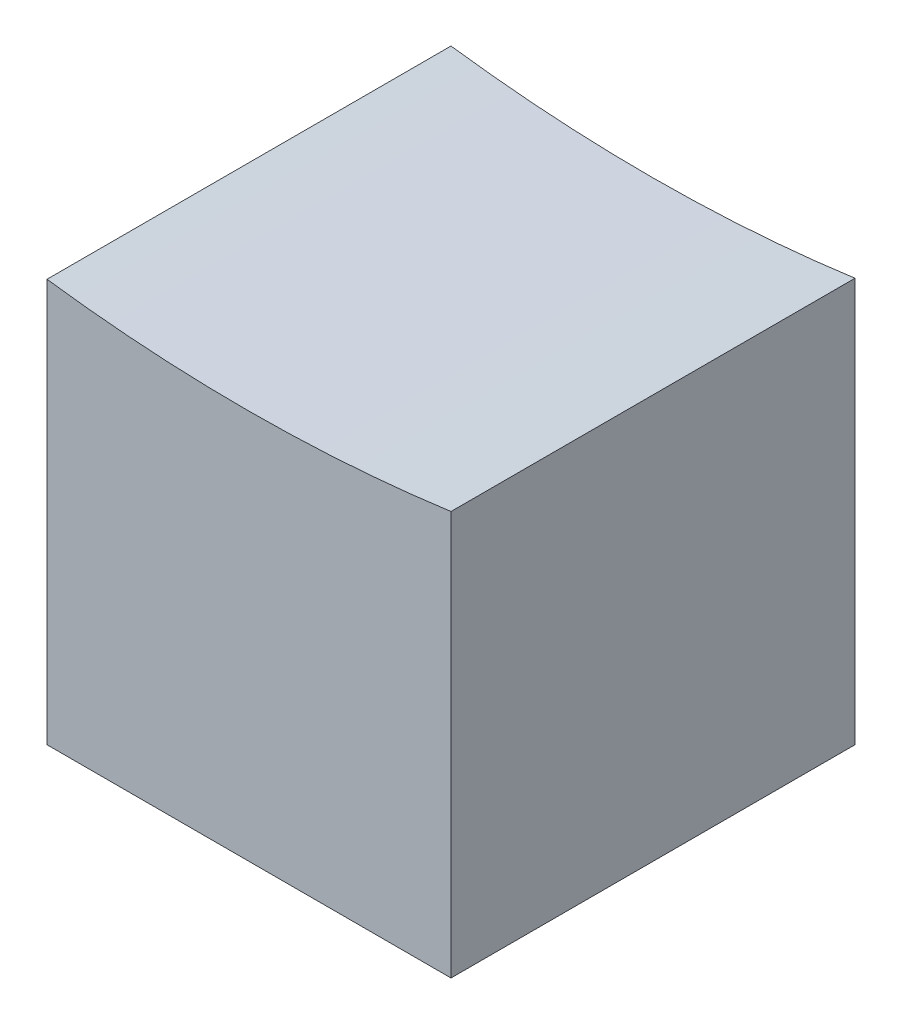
ISO-10303-21;
HEADER;
FILE_DESCRIPTION(('STEP AP214'),'2;1');
FILE_NAME('part.step','',(''),(''),'','','');
FILE_SCHEMA(('AUTOMOTIVE_DESIGN { 1 0 10303 214 1 1 1 1 }'));
ENDSEC;
DATA;
#1=APPLICATION_CONTEXT('core data for automotive mechanical design processes');
#2=APPLICATION_PROTOCOL_DEFINITION('international standard','automotive_design',2000,#1);
#3=PRODUCT_CONTEXT('',#1,'mechanical');
#4=PRODUCT('Part','Part','',(#3));
#5=PRODUCT_RELATED_PRODUCT_CATEGORY('part','',(#4));
#6=PRODUCT_DEFINITION_FORMATION('','',#4);
#7=PRODUCT_DEFINITION_CONTEXT('part definition',#1,'design');
#8=PRODUCT_DEFINITION('design','',#6,#7);
#9=PRODUCT_DEFINITION_SHAPE('','',#8);
#10=(LENGTH_UNIT() NAMED_UNIT(*) SI_UNIT(.MILLI.,.METRE.));
#11=(NAMED_UNIT(*) PLANE_ANGLE_UNIT() SI_UNIT($,.RADIAN.));
#12=(NAMED_UNIT(*) SI_UNIT($,.STERADIAN.) SOLID_ANGLE_UNIT());
#13=UNCERTAINTY_MEASURE_WITH_UNIT(LENGTH_MEASURE(1.E-05),#10,'distance_accuracy_value','');
#14=(GEOMETRIC_REPRESENTATION_CONTEXT(3) GLOBAL_UNCERTAINTY_ASSIGNED_CONTEXT((#13)) GLOBAL_UNIT_ASSIGNED_CONTEXT((#10,
#11,#12)) REPRESENTATION_CONTEXT('',''));
#15=CARTESIAN_POINT('',(0.,0.,0.));
#16=DIRECTION('',(0.,0.,1.));
#17=DIRECTION('',(1.,0.,0.));
#18=AXIS2_PLACEMENT_3D('',#15,#16,#17);
#19=CARTESIAN_POINT('',(0.,0.,30.));
#20=DIRECTION('',(0.,0.,-1.));
#21=DIRECTION('',(-1.,0.,0.));
#22=AXIS2_PLACEMENT_3D('',#19,#20,#21);
#23=CYLINDRICAL_SURFACE('',#22,111.3);
#24=CARTESIAN_POINT('',(0.,0.,0.));
#25=DIRECTION('',(0.,0.,-1.));
#26=DIRECTION('',(1.,0.,0.));
#27=AXIS2_PLACEMENT_3D('',#24,#25,#26);
#28=CIRCLE('',#27,111.3);
#29=CARTESIAN_POINT('',(15.2441713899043,-110.251100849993,0.));
#30=VERTEX_POINT('',#29);
#31=CARTESIAN_POINT('',(-14.7558286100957,-110.317521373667,0.));
#32=VERTEX_POINT('',#31);
#33=EDGE_CURVE('E96',#30,#32,#28,.T.);
#34=ORIENTED_EDGE('',*,*,#33,.T.);
#35=DIRECTION('',(0.,0.,-1.));
#36=VECTOR('',#35,1.);
#37=CARTESIAN_POINT('',(-14.7558286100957,-110.317521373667,30.));
#38=LINE('',#37,#36);
#39=CARTESIAN_POINT('',(-14.7558286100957,-110.317521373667,30.));
#40=VERTEX_POINT('',#39);
#41=EDGE_CURVE('E11',#40,#32,#38,.T.);
#42=ORIENTED_EDGE('',*,*,#41,.F.);
#43=CARTESIAN_POINT('',(0.,0.,30.));
#44=DIRECTION('',(0.,0.,-1.));
#45=DIRECTION('',(1.,0.,0.));
#46=AXIS2_PLACEMENT_3D('',#43,#44,#45);
#47=CIRCLE('',#46,111.3);
#48=CARTESIAN_POINT('',(15.2441713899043,-110.251100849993,30.));
#49=VERTEX_POINT('',#48);
#50=EDGE_CURVE('E84',#49,#40,#47,.T.);
#51=ORIENTED_EDGE('',*,*,#50,.F.);
#52=DIRECTION('',(0.,0.,-1.));
#53=VECTOR('',#52,1.);
#54=CARTESIAN_POINT('',(15.2441713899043,-110.251100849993,30.));
#55=LINE('',#54,#53);
#56=EDGE_CURVE('E92',#49,#30,#55,.T.);
#57=ORIENTED_EDGE('',*,*,#56,.T.);
#58=EDGE_LOOP('',(#34,#42,#51,#57));
#59=FACE_BOUND('',#58,.T.);
#60=ADVANCED_FACE('F33',(#59),#23,.F.);
#61=CARTESIAN_POINT('',(-14.7558286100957,-110.317521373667,30.));
#62=DIRECTION('',(1.,0.,0.));
#63=DIRECTION('',(0.,1.,0.));
#64=AXIS2_PLACEMENT_3D('',#61,#62,#63);
#65=PLANE('',#64);
#66=DIRECTION('',(0.,-1.,0.));
#67=VECTOR('',#66,1.);
#68=CARTESIAN_POINT('',(-14.7558286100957,-110.317521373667,0.));
#69=LINE('',#68,#67);
#70=CARTESIAN_POINT('',(-14.7558286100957,-140.251100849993,0.));
#71=VERTEX_POINT('',#70);
#72=EDGE_CURVE('E88',#32,#71,#69,.T.);
#73=ORIENTED_EDGE('',*,*,#72,.T.);
#74=DIRECTION('',(0.,0.,-1.));
#75=VECTOR('',#74,1.);
#76=CARTESIAN_POINT('',(-14.7558286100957,-140.251100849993,30.));
#77=LINE('',#76,#75);
#78=CARTESIAN_POINT('',(-14.7558286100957,-140.251100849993,30.));
#79=VERTEX_POINT('',#78);
#80=EDGE_CURVE('E41',#79,#71,#77,.T.);
#81=ORIENTED_EDGE('',*,*,#80,.F.);
#82=DIRECTION('',(0.,-1.,0.));
#83=VECTOR('',#82,1.);
#84=CARTESIAN_POINT('',(-14.7558286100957,-110.317521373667,30.));
#85=LINE('',#84,#83);
#86=EDGE_CURVE('E79',#40,#79,#85,.T.);
#87=ORIENTED_EDGE('',*,*,#86,.F.);
#88=ORIENTED_EDGE('',*,*,#41,.T.);
#89=EDGE_LOOP('',(#73,#81,#87,#88));
#90=FACE_BOUND('',#89,.T.);
#91=ADVANCED_FACE('F87',(#90),#65,.F.);
#92=CARTESIAN_POINT('',(-14.7558286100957,-140.251100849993,30.));
#93=DIRECTION('',(0.,1.,0.));
#94=DIRECTION('',(0.,0.,1.));
#95=AXIS2_PLACEMENT_3D('',#92,#93,#94);
#96=PLANE('',#95);
#97=DIRECTION('',(1.,0.,0.));
#98=VECTOR('',#97,1.);
#99=CARTESIAN_POINT('',(-14.7558286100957,-140.251100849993,0.));
#100=LINE('',#99,#98);
#101=CARTESIAN_POINT('',(15.2441713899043,-140.251100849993,0.));
#102=VERTEX_POINT('',#101);
#103=EDGE_CURVE('E66',#71,#102,#100,.T.);
#104=ORIENTED_EDGE('',*,*,#103,.T.);
#105=DIRECTION('',(0.,0.,-1.));
#106=VECTOR('',#105,1.);
#107=CARTESIAN_POINT('',(15.2441713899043,-140.251100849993,30.));
#108=LINE('',#107,#106);
#109=CARTESIAN_POINT('',(15.2441713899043,-140.251100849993,30.));
#110=VERTEX_POINT('',#109);
#111=EDGE_CURVE('E89',#110,#102,#108,.T.);
#112=ORIENTED_EDGE('',*,*,#111,.F.);
#113=DIRECTION('',(1.,0.,0.));
#114=VECTOR('',#113,1.);
#115=CARTESIAN_POINT('',(-14.7558286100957,-140.251100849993,30.));
#116=LINE('',#115,#114);
#117=EDGE_CURVE('E82',#79,#110,#116,.T.);
#118=ORIENTED_EDGE('',*,*,#117,.F.);
#119=ORIENTED_EDGE('',*,*,#80,.T.);
#120=EDGE_LOOP('',(#104,#112,#118,#119));
#121=FACE_BOUND('',#120,.T.);
#122=ADVANCED_FACE('F90',(#121),#96,.F.);
#123=CARTESIAN_POINT('',(15.2441713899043,-110.251100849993,30.));
#124=DIRECTION('',(-1.,0.,0.));
#125=DIRECTION('',(0.,-1.,0.));
#126=AXIS2_PLACEMENT_3D('',#123,#124,#125);
#127=PLANE('',#126);
#128=DIRECTION('',(0.,1.,0.));
#129=VECTOR('',#128,1.);
#130=CARTESIAN_POINT('',(15.2441713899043,-110.251100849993,0.));
#131=LINE('',#130,#129);
#132=EDGE_CURVE('E72',#102,#30,#131,.T.);
#133=ORIENTED_EDGE('',*,*,#132,.T.);
#134=ORIENTED_EDGE('',*,*,#56,.F.);
#135=DIRECTION('',(0.,1.,0.));
#136=VECTOR('',#135,1.);
#137=CARTESIAN_POINT('',(15.2441713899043,-110.251100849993,30.));
#138=LINE('',#137,#136);
#139=EDGE_CURVE('E49',#110,#49,#138,.T.);
#140=ORIENTED_EDGE('',*,*,#139,.F.);
#141=ORIENTED_EDGE('',*,*,#111,.T.);
#142=EDGE_LOOP('',(#133,#134,#140,#141));
#143=FACE_BOUND('',#142,.T.);
#144=ADVANCED_FACE('F103',(#143),#127,.F.);
#145=CARTESIAN_POINT('',(0.,0.,30.));
#146=DIRECTION('',(0.,0.,1.));
#147=DIRECTION('',(1.,0.,0.));
#148=AXIS2_PLACEMENT_3D('',#145,#146,#147);
#149=PLANE('',#148);
#150=ORIENTED_EDGE('',*,*,#50,.T.);
#151=ORIENTED_EDGE('',*,*,#86,.T.);
#152=ORIENTED_EDGE('',*,*,#117,.T.);
#153=ORIENTED_EDGE('',*,*,#139,.T.);
#154=EDGE_LOOP('',(#150,#151,#152,#153));
#155=FACE_BOUND('',#154,.T.);
#156=ADVANCED_FACE('F80',(#155),#149,.T.);
#157=CARTESIAN_POINT('',(0.,0.,0.));
#158=DIRECTION('',(0.,0.,1.));
#159=DIRECTION('',(1.,0.,0.));
#160=AXIS2_PLACEMENT_3D('',#157,#158,#159);
#161=PLANE('',#160);
#162=ORIENTED_EDGE('',*,*,#33,.F.);
#163=ORIENTED_EDGE('',*,*,#132,.F.);
#164=ORIENTED_EDGE('',*,*,#103,.F.);
#165=ORIENTED_EDGE('',*,*,#72,.F.);
#166=EDGE_LOOP('',(#162,#163,#164,#165));
#167=FACE_BOUND('',#166,.T.);
#168=ADVANCED_FACE('F106',(#167),#161,.F.);
#169=CLOSED_SHELL('',(#60,#91,#122,#144,#156,#168));
#170=MANIFOLD_SOLID_BREP('B2',#169);
#171=ADVANCED_BREP_SHAPE_REPRESENTATION('',(#18,#170),#14);
#172=SHAPE_DEFINITION_REPRESENTATION(#9,#171);
ENDSEC;
END-ISO-10303-21;
